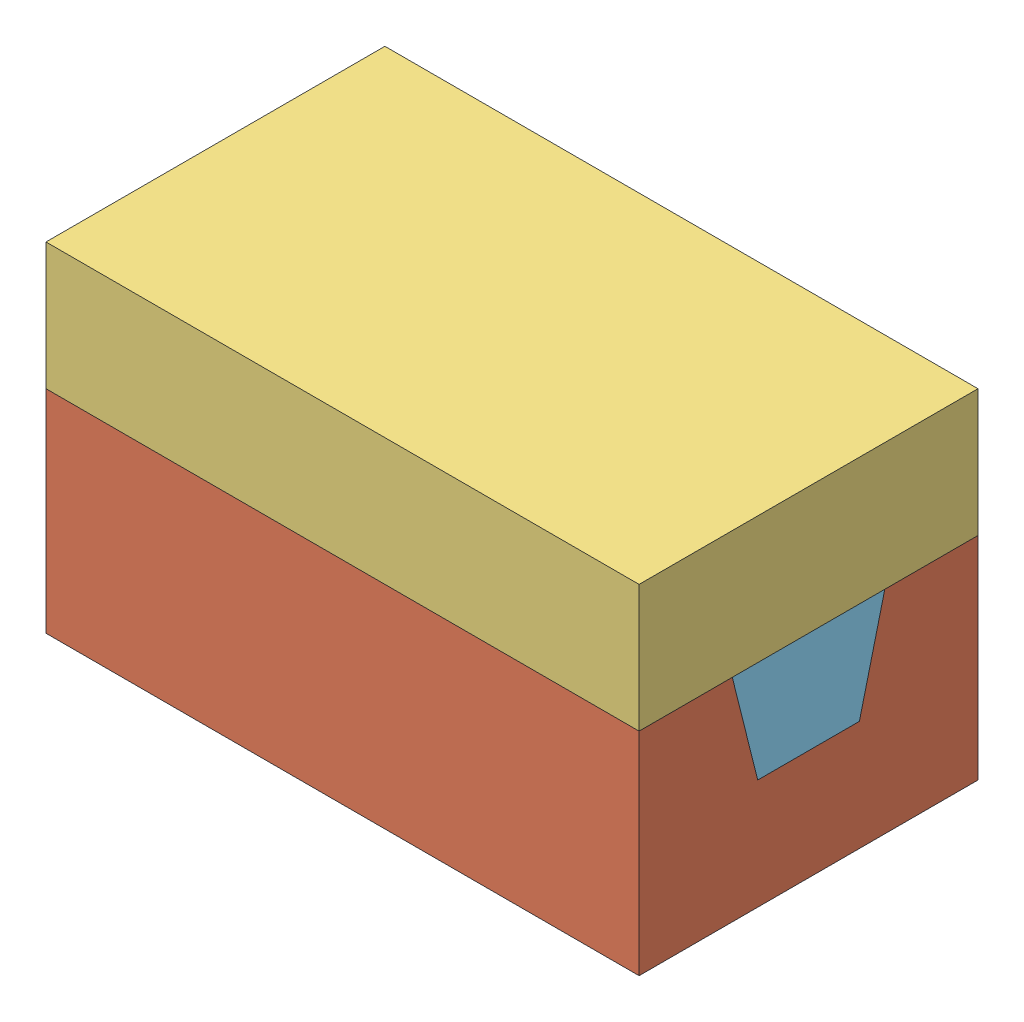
SolidWorks assembly Assem1.sldasm, configuration Default (file format 6000). Lengths in mm.
Overall size (700 400 400).
5 component instances, 5 part files, 9 mates.
Components (placement in the parent):
- Base-1: Base.sldprt [Default] at (173.546 -237.1616 679.1719) size (470.53 200 270.53)
- Cavity-1: Cavity.sldprt [Default] at (173.546 84.2599 679.1719) size (700 250 400)
- Core-1: Core.sldprt [Default] at (173.546 -590.7939 679.1719) size (700 330 400)
- LeftCore-1: LeftCore.sldprt [Default] at (364.4433 -237.1616 679.1719) size (148.38 120 180)
- RightCore-1: RightCore.sldprt [Default] at (-109.6182 -237.1616 679.1719) size (148.38 120 180)
Mates (geometry in assembly coordinates):
- Coincident1: coincident aligned: plane of Cavity-1 through (523.546 112.8384 879.1719) normal (1 0 0); plane of RightCore-1 through (523.546 112.8384 879.1719) normal (1 0 0)
- Coincident2: coincident aligned: line of Cavity-1 through (523.546 -157.1616 619.1719) axis (0 0 1); line of RightCore-1 through (523.546 -157.1616 619.1719) axis (0 0 1)
- Coincident3: coincident aligned: line of Cavity-1 through (523.546 -157.1616 739.1719) axis (0 0.970143 0.242536); line of RightCore-1 through (523.546 -157.1616 739.1719) axis (0 0.970143 0.242536)
- Coincident4: coincident: line of Cavity-1 through (-176.454 -37.1616 769.1719) axis (1 0 0); line of LeftCore-1 through (-176.454 -37.1616 769.1719) axis (1 0 0)
- Coincident5: coincident aligned: plane of Cavity-1 through (-176.454 112.8384 879.1719) normal (-1 0 0); plane of LeftCore-1 through (-176.454 112.8384 879.1719) normal (-1 0 0)
- Coincident6: coincident aligned: line of Base-1 through (13.546 -37.1616 814.4373) axis (1 0 0); line of Cavity-1 through (13.546 -37.1616 814.4373) axis (1 0 0)
- Coincident7: coincident aligned: line of Base-1 through (408.8114 -37.1616 739.1719) axis (0 0 -1); line of RightCore-1 through (408.8114 -37.1616 739.1719) axis (0 0 -1)
- Coincident8: coincident: line of Cavity-1 through (-176.454 -37.1616 879.1719) axis (1 0 0); line of Core-1 through (-176.454 -37.1616 879.1719) axis (1 0 0)
- Coincident9: coincident aligned: plane of Cavity-1 through (523.546 112.8384 879.1719) normal (1 0 0); plane of Core-1 through (523.546 112.8384 879.1719) normal (1 0 0)
